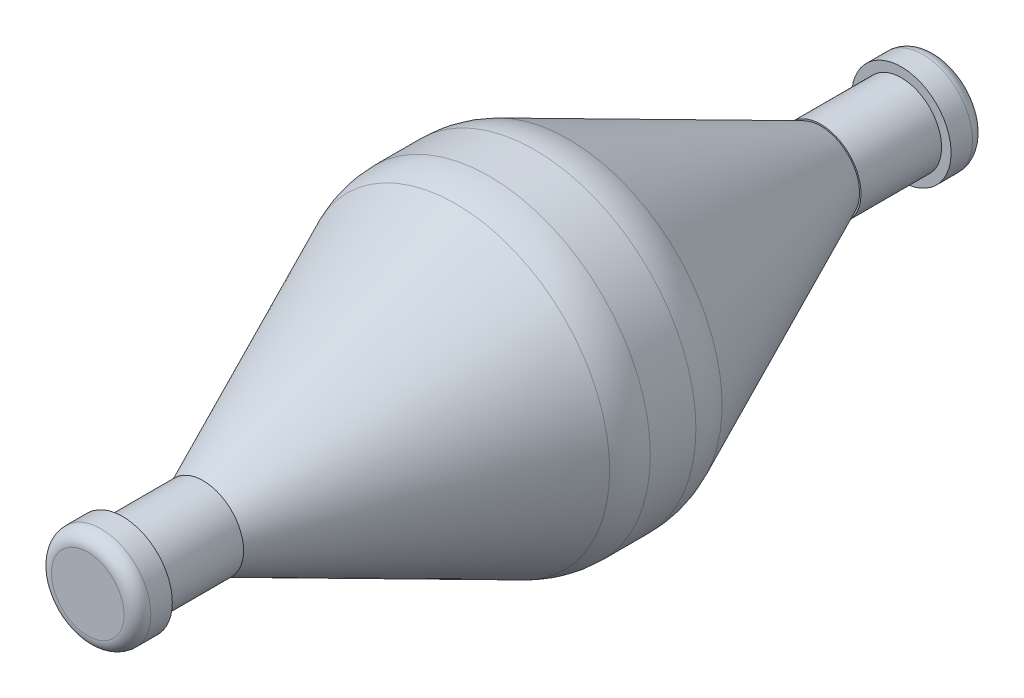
from build123d import *

# Parameters (mm, degrees)
EXTRUSION1_DEPTH      = 1.5
EXTRUSION1_DEPTH_BACK = 1.5
ESQUISSE1_R           = 6
ESQUISSE2_R           = 6
EXTRUSION2_DEPTH      = 10
EXTRUSION2_TAPER      = 24.5
ESQUISSE3_R           = 6
EXTRUSION3_DEPTH      = 10
EXTRUSION3_TAPER      = 24.5
ESQUISSE4_R           = 1.497979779
EXTRUSION4_DEPTH      = 3
ESQUISSE5_R           = 1.504
EXTRUSION5_DEPTH      = 3
ESQUISSE6_R           = 1.85
EXTRUSION6_DEPTH      = 1.3
EXTRUSION7_START      = 1.3
ESQUISSE7_R           = 1.85
EXTRUSION7_DEPTH      = 1.3
CONG_1_R              = 3
CONG_2_R              = 0.5


with BuildPart() as part:
    # Esquisse1 → Extrusion1 (new, two sides: drawn at the far end of the back side and taken through both)
    with BuildSketch(Plane.XY.offset(-EXTRUSION1_DEPTH_BACK)):
        Circle(ESQUISSE1_R)
    extrude(amount=EXTRUSION1_DEPTH + EXTRUSION1_DEPTH_BACK)

    # Esquisse2 → Extrusion2 (add)
    with BuildSketch(Plane.XY.offset(1.5)):
        Circle(ESQUISSE2_R)
    extrude(amount=EXTRUSION2_DEPTH, taper=EXTRUSION2_TAPER)

    # Esquisse3 → Extrusion3 (add)
    with BuildSketch(Plane(origin=(0, 0, -1.5), x_dir=(-1, 0, 0), z_dir=(0, 0, -1))):
        Circle(ESQUISSE3_R)
    extrude(amount=EXTRUSION3_DEPTH, taper=EXTRUSION3_TAPER)

    # Esquisse4 → Extrusion4 (add)
    with BuildSketch(Plane(origin=(0, 0, -11.5), x_dir=(-1, 0, 0), z_dir=(0, 0, -1))):
        Circle(ESQUISSE4_R)
    extrude(amount=EXTRUSION4_DEPTH)

    # Esquisse5 → Extrusion5 (add)
    with BuildSketch(Plane.XY.offset(11.5)):
        Circle(ESQUISSE5_R)
    extrude(amount=EXTRUSION5_DEPTH)

    # Esquisse6 → Extrusion6 (add)
    with BuildSketch(Plane.XY.offset(14.5)):
        Circle(ESQUISSE6_R)
    extrude(amount=EXTRUSION6_DEPTH)

    # Esquisse7 → Extrusion7 (add)
    with BuildSketch(Plane(origin=(0, 0, -14.5), x_dir=(-1, 0, 0), z_dir=(0, 0, -1)).offset(EXTRUSION7_START)):
        with Locations(Location((0, 0, 0), (0, 0, 180))):
            Circle(ESQUISSE7_R)
    extrude(amount=-EXTRUSION7_DEPTH)

    # Cong_1
    cong_1_edges = [part.edges().sort_by_distance(p)[0] for p in [
        (0, 6, -1.5),
        (-6, 0, 1.5),
    ]]
    fillet(cong_1_edges, radius=CONG_1_R)

    # Cong_2
    cong_2_edges = [part.edges().sort_by_distance(p)[0] for p in [
        (-1.85, 0, 15.8),
        (-1.85, 0, -15.8),
    ]]
    fillet(cong_2_edges, radius=CONG_2_R)


solid = part.part
